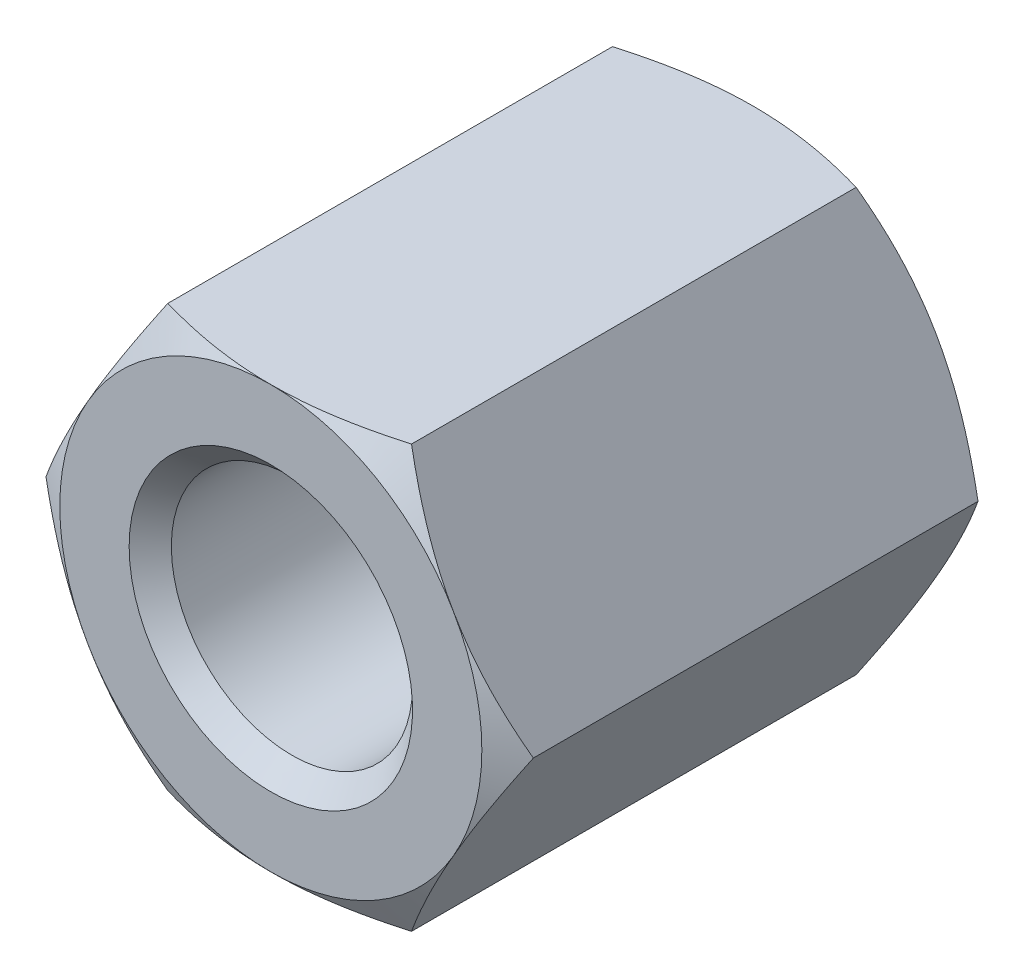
ISO-10303-21;
HEADER;
FILE_DESCRIPTION(('STEP AP214'),'2;1');
FILE_NAME('part.step','',(''),(''),'','','');
FILE_SCHEMA(('AUTOMOTIVE_DESIGN { 1 0 10303 214 1 1 1 1 }'));
ENDSEC;
DATA;
#1=APPLICATION_CONTEXT('core data for automotive mechanical design processes');
#2=APPLICATION_PROTOCOL_DEFINITION('international standard','automotive_design',2000,#1);
#3=PRODUCT_CONTEXT('',#1,'mechanical');
#4=PRODUCT('Part','Part','',(#3));
#5=PRODUCT_RELATED_PRODUCT_CATEGORY('part','',(#4));
#6=PRODUCT_DEFINITION_FORMATION('','',#4);
#7=PRODUCT_DEFINITION_CONTEXT('part definition',#1,'design');
#8=PRODUCT_DEFINITION('design','',#6,#7);
#9=PRODUCT_DEFINITION_SHAPE('','',#8);
#10=(LENGTH_UNIT() NAMED_UNIT(*) SI_UNIT(.MILLI.,.METRE.));
#11=(NAMED_UNIT(*) PLANE_ANGLE_UNIT() SI_UNIT($,.RADIAN.));
#12=(NAMED_UNIT(*) SI_UNIT($,.STERADIAN.) SOLID_ANGLE_UNIT());
#13=UNCERTAINTY_MEASURE_WITH_UNIT(LENGTH_MEASURE(1.E-05),#10,'distance_accuracy_value','');
#14=(GEOMETRIC_REPRESENTATION_CONTEXT(3) GLOBAL_UNCERTAINTY_ASSIGNED_CONTEXT((#13)) GLOBAL_UNIT_ASSIGNED_CONTEXT((#10,
#11,#12)) REPRESENTATION_CONTEXT('',''));
#15=CARTESIAN_POINT('',(0.,0.,0.));
#16=DIRECTION('',(0.,0.,1.));
#17=DIRECTION('',(1.,0.,0.));
#18=AXIS2_PLACEMENT_3D('',#15,#16,#17);
#19=CARTESIAN_POINT('',(4.04145188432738,0.,-4.));
#20=DIRECTION('',(0.866025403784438,0.5,0.));
#21=DIRECTION('',(-0.5,0.866025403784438,0.));
#22=AXIS2_PLACEMENT_3D('',#19,#20,#21);
#23=PLANE('',#22);
#24=CARTESIAN_POINT('',(4.04156735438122,-0.00019999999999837,3.68732593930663));
#25=CARTESIAN_POINT('',(3.9527667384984,0.153607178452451,3.73861421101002));
#26=CARTESIAN_POINT('',(3.86319960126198,0.308742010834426,3.7852590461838));
#27=CARTESIAN_POINT('',(3.68251437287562,0.621698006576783,3.86667812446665));
#28=CARTESIAN_POINT('',(3.59139307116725,0.779524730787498,3.90142356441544));
#29=CARTESIAN_POINT('',(3.41027974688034,1.09322221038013,3.95550997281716));
#30=CARTESIAN_POINT('',(3.32031559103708,1.24904469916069,3.97521091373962));
#31=CARTESIAN_POINT('',(3.13996396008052,1.56142288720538,3.99872986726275));
#32=CARTESIAN_POINT('',(3.04957714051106,1.71797745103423,4.00256735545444));
#33=CARTESIAN_POINT('',(2.88068384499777,2.01050921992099,3.99458469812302));
#34=CARTESIAN_POINT('',(2.80215208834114,2.14653021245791,3.98472456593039));
#35=CARTESIAN_POINT('',(2.64560020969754,2.417686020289,3.9534735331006));
#36=CARTESIAN_POINT('',(2.5675806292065,2.55281989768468,3.9320719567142));
#37=CARTESIAN_POINT('',(2.41070596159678,2.82453479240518,3.87856959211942));
#38=CARTESIAN_POINT('',(2.33187072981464,2.96108141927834,3.84624200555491));
#39=CARTESIAN_POINT('',(2.17537608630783,3.2321380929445,3.77287106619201));
#40=CARTESIAN_POINT('',(2.09771466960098,3.36665161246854,3.73184495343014));
#41=CARTESIAN_POINT('',(2.02061047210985,3.5002,3.68732593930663));
#42=B_SPLINE_CURVE_WITH_KNOTS('',3,(#24,#25,#26,#27,#28,#29,#30,#31,#32,#33,#34,#35,#36,#37,#38,
#39,#40,#41),.UNSPECIFIED.,.F.,.F.,(4,2,2,2,2,2,2,2,4),(0.,0.554793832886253,1.11092123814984,
1.65328467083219,2.19498204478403,2.6666513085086,3.13875761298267,3.62133612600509,
4.10296698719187),.UNSPECIFIED.);
#43=CARTESIAN_POINT('',(4.04145188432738,0.,3.68739260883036));
#44=VERTEX_POINT('',#43);
#45=CARTESIAN_POINT('',(3.03108891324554,1.75,4.));
#46=VERTEX_POINT('',#45);
#47=EDGE_CURVE('E127',#44,#46,#42,.T.);
#48=ORIENTED_EDGE('',*,*,#47,.F.);
#49=DIRECTION('',(0.,0.,1.));
#50=VECTOR('',#49,1.);
#51=CARTESIAN_POINT('',(4.04145188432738,0.,-4.));
#52=LINE('',#51,#50);
#53=CARTESIAN_POINT('',(4.04145188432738,0.,-3.68739260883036));
#54=VERTEX_POINT('',#53);
#55=EDGE_CURVE('E564',#54,#44,#52,.T.);
#56=ORIENTED_EDGE('',*,*,#55,.F.);
#57=CARTESIAN_POINT('',(4.04156735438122,-0.00019999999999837,-3.68732593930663));
#58=CARTESIAN_POINT('',(3.9527667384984,0.153607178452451,-3.73861421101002));
#59=CARTESIAN_POINT('',(3.86319960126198,0.308742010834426,-3.7852590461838));
#60=CARTESIAN_POINT('',(3.68251437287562,0.621698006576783,-3.86667812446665));
#61=CARTESIAN_POINT('',(3.59139307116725,0.779524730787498,-3.90142356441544));
#62=CARTESIAN_POINT('',(3.41027974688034,1.09322221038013,-3.95550997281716));
#63=CARTESIAN_POINT('',(3.32031559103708,1.24904469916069,-3.97521091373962));
#64=CARTESIAN_POINT('',(3.13996396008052,1.56142288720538,-3.99872986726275));
#65=CARTESIAN_POINT('',(3.04957714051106,1.71797745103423,-4.00256735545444));
#66=CARTESIAN_POINT('',(2.88068384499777,2.01050921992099,-3.99458469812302));
#67=CARTESIAN_POINT('',(2.80215208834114,2.14653021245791,-3.98472456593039));
#68=CARTESIAN_POINT('',(2.64560020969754,2.417686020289,-3.9534735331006));
#69=CARTESIAN_POINT('',(2.5675806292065,2.55281989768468,-3.9320719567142));
#70=CARTESIAN_POINT('',(2.41070596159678,2.82453479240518,-3.87856959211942));
#71=CARTESIAN_POINT('',(2.33187072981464,2.96108141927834,-3.84624200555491));
#72=CARTESIAN_POINT('',(2.17537608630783,3.2321380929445,-3.77287106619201));
#73=CARTESIAN_POINT('',(2.09771466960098,3.36665161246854,-3.73184495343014));
#74=CARTESIAN_POINT('',(2.02061047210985,3.5002,-3.68732593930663));
#75=B_SPLINE_CURVE_WITH_KNOTS('',3,(#57,#58,#59,#60,#61,#62,#63,#64,#65,#66,#67,#68,#69,#70,#71,
#72,#73,#74),.UNSPECIFIED.,.F.,.F.,(4,2,2,2,2,2,2,2,4),(0.,0.554793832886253,1.11092123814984,
1.65328467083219,2.19498204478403,2.6666513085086,3.13875761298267,3.62133612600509,
4.10296698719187),.UNSPECIFIED.);
#76=CARTESIAN_POINT('',(3.03108891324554,1.75,-4.));
#77=VERTEX_POINT('',#76);
#78=EDGE_CURVE('E568',#54,#77,#75,.T.);
#79=ORIENTED_EDGE('',*,*,#78,.T.);
#80=CARTESIAN_POINT('',(2.02072594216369,3.5,-3.68739260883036));
#81=VERTEX_POINT('',#80);
#82=EDGE_CURVE('E268',#77,#81,#75,.T.);
#83=ORIENTED_EDGE('',*,*,#82,.T.);
#84=DIRECTION('',(0.,0.,1.));
#85=VECTOR('',#84,1.);
#86=CARTESIAN_POINT('',(2.02072594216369,3.5,-4.));
#87=LINE('',#86,#85);
#88=CARTESIAN_POINT('',(2.02072594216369,3.5,3.68739260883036));
#89=VERTEX_POINT('',#88);
#90=EDGE_CURVE('E159',#81,#89,#87,.T.);
#91=ORIENTED_EDGE('',*,*,#90,.T.);
#92=EDGE_CURVE('E140',#46,#89,#42,.T.);
#93=ORIENTED_EDGE('',*,*,#92,.F.);
#94=EDGE_LOOP('',(#48,#56,#79,#83,#91,#93));
#95=FACE_BOUND('',#94,.T.);
#96=ADVANCED_FACE('F41',(#95),#23,.T.);
#97=CARTESIAN_POINT('',(2.02072594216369,-3.5,-4.));
#98=DIRECTION('',(0.866025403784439,-0.5,0.));
#99=DIRECTION('',(0.5,0.866025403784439,0.));
#100=AXIS2_PLACEMENT_3D('',#97,#98,#99);
#101=PLANE('',#100);
#102=CARTESIAN_POINT('',(2.02061047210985,-3.5002,3.68732593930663));
#103=CARTESIAN_POINT('',(2.10941108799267,-3.34639282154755,3.73861421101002));
#104=CARTESIAN_POINT('',(2.19897822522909,-3.19125798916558,3.7852590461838));
#105=CARTESIAN_POINT('',(2.37966345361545,-2.87830199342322,3.86667812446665));
#106=CARTESIAN_POINT('',(2.47078475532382,-2.7204752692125,3.90142356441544));
#107=CARTESIAN_POINT('',(2.65189807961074,-2.40677778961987,3.95550997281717));
#108=CARTESIAN_POINT('',(2.74186223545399,-2.25095530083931,3.97521091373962));
#109=CARTESIAN_POINT('',(2.92221386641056,-1.93857711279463,3.99872986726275));
#110=CARTESIAN_POINT('',(3.01260068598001,-1.78202254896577,4.00256735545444));
#111=CARTESIAN_POINT('',(3.1814939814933,-1.48949078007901,3.99458469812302));
#112=CARTESIAN_POINT('',(3.26002573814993,-1.35346978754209,3.98472456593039));
#113=CARTESIAN_POINT('',(3.41657761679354,-1.082313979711,3.9534735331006));
#114=CARTESIAN_POINT('',(3.49459719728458,-0.947180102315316,3.9320719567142));
#115=CARTESIAN_POINT('',(3.65147186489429,-0.675465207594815,3.87856959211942));
#116=CARTESIAN_POINT('',(3.73030709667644,-0.538918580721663,3.84624200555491));
#117=CARTESIAN_POINT('',(3.88680174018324,-0.267861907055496,3.77287106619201));
#118=CARTESIAN_POINT('',(3.96446315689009,-0.133348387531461,3.73184495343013));
#119=CARTESIAN_POINT('',(4.04156735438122,0.000200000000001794,3.68732593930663));
#120=B_SPLINE_CURVE_WITH_KNOTS('',3,(#102,#103,#104,#105,#106,#107,#108,#109,#110,#111,#112,
#113,#114,#115,#116,#117,#118,#119),.UNSPECIFIED.,.F.,.F.,(4,2,2,2,2,2,2,2,4),(0.,
0.554793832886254,1.11092123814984,1.65328467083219,2.19498204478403,2.6666513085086,
3.13875761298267,3.6213361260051,4.10296698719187),.UNSPECIFIED.);
#121=CARTESIAN_POINT('',(2.02072594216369,-3.5,3.68739260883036));
#122=VERTEX_POINT('',#121);
#123=CARTESIAN_POINT('',(3.03108891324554,-1.75,4.));
#124=VERTEX_POINT('',#123);
#125=EDGE_CURVE('E553',#122,#124,#120,.T.);
#126=ORIENTED_EDGE('',*,*,#125,.F.);
#127=DIRECTION('',(0.,0.,1.));
#128=VECTOR('',#127,1.);
#129=CARTESIAN_POINT('',(2.02072594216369,-3.5,-4.));
#130=LINE('',#129,#128);
#131=CARTESIAN_POINT('',(2.02072594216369,-3.5,-3.68739260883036));
#132=VERTEX_POINT('',#131);
#133=EDGE_CURVE('E282',#132,#122,#130,.T.);
#134=ORIENTED_EDGE('',*,*,#133,.F.);
#135=CARTESIAN_POINT('',(2.02061047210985,-3.5002,-3.68732593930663));
#136=CARTESIAN_POINT('',(2.10941108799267,-3.34639282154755,-3.73861421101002));
#137=CARTESIAN_POINT('',(2.19897822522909,-3.19125798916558,-3.7852590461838));
#138=CARTESIAN_POINT('',(2.37966345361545,-2.87830199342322,-3.86667812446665));
#139=CARTESIAN_POINT('',(2.47078475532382,-2.7204752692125,-3.90142356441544));
#140=CARTESIAN_POINT('',(2.65189807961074,-2.40677778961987,-3.95550997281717));
#141=CARTESIAN_POINT('',(2.74186223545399,-2.25095530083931,-3.97521091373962));
#142=CARTESIAN_POINT('',(2.92221386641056,-1.93857711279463,-3.99872986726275));
#143=CARTESIAN_POINT('',(3.01260068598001,-1.78202254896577,-4.00256735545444));
#144=CARTESIAN_POINT('',(3.1814939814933,-1.48949078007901,-3.99458469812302));
#145=CARTESIAN_POINT('',(3.26002573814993,-1.35346978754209,-3.98472456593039));
#146=CARTESIAN_POINT('',(3.41657761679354,-1.082313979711,-3.9534735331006));
#147=CARTESIAN_POINT('',(3.49459719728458,-0.947180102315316,-3.9320719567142));
#148=CARTESIAN_POINT('',(3.65147186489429,-0.675465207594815,-3.87856959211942));
#149=CARTESIAN_POINT('',(3.73030709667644,-0.538918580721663,-3.84624200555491));
#150=CARTESIAN_POINT('',(3.88680174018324,-0.267861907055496,-3.77287106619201));
#151=CARTESIAN_POINT('',(3.96446315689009,-0.133348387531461,-3.73184495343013));
#152=CARTESIAN_POINT('',(4.04156735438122,0.000200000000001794,-3.68732593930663));
#153=B_SPLINE_CURVE_WITH_KNOTS('',3,(#135,#136,#137,#138,#139,#140,#141,#142,#143,#144,#145,
#146,#147,#148,#149,#150,#151,#152),.UNSPECIFIED.,.F.,.F.,(4,2,2,2,2,2,2,2,4),(0.,
0.554793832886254,1.11092123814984,1.65328467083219,2.19498204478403,2.6666513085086,
3.13875761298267,3.6213361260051,4.10296698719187),.UNSPECIFIED.);
#154=CARTESIAN_POINT('',(3.03108891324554,-1.75,-4.));
#155=VERTEX_POINT('',#154);
#156=EDGE_CURVE('E554',#132,#155,#153,.T.);
#157=ORIENTED_EDGE('',*,*,#156,.T.);
#158=EDGE_CURVE('E283',#155,#54,#153,.T.);
#159=ORIENTED_EDGE('',*,*,#158,.T.);
#160=ORIENTED_EDGE('',*,*,#55,.T.);
#161=EDGE_CURVE('E132',#124,#44,#120,.T.);
#162=ORIENTED_EDGE('',*,*,#161,.F.);
#163=EDGE_LOOP('',(#126,#134,#157,#159,#160,#162));
#164=FACE_BOUND('',#163,.T.);
#165=ADVANCED_FACE('F253',(#164),#101,.T.);
#166=CARTESIAN_POINT('',(-2.02072594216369,-3.5,-4.));
#167=DIRECTION('',(0.,-1.,0.));
#168=DIRECTION('',(1.,0.,0.));
#169=AXIS2_PLACEMENT_3D('',#166,#167,#168);
#170=PLANE('',#169);
#171=CARTESIAN_POINT('',(-9.62975784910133,-3.5,0.105146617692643));
#172=CARTESIAN_POINT('',(-9.41477605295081,-3.5,0.221790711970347));
#173=CARTESIAN_POINT('',(-9.19961018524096,-3.5,0.338097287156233));
#174=CARTESIAN_POINT('',(-8.76881431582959,-3.5,0.569857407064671));
#175=CARTESIAN_POINT('',(-8.55318430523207,-3.5,0.685310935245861));
#176=CARTESIAN_POINT('',(-8.12120692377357,-3.5,0.915270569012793));
#177=CARTESIAN_POINT('',(-7.90485912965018,-3.5,1.02977588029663));
#178=CARTESIAN_POINT('',(-7.47148736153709,-3.5,1.25749687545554));
#179=CARTESIAN_POINT('',(-7.2544633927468,-3.5,1.37071256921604));
#180=CARTESIAN_POINT('',(-6.81218472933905,-3.5,1.59934512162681));
#181=CARTESIAN_POINT('',(-6.5869010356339,-3.5,1.71470597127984));
#182=CARTESIAN_POINT('',(-6.13520328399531,-3.5,1.94319180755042));
#183=CARTESIAN_POINT('',(-5.90878923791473,-3.5,2.05631681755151));
#184=CARTESIAN_POINT('',(-5.45458188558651,-3.5,2.27959153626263));
#185=CARTESIAN_POINT('',(-5.22678903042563,-3.5,2.38974215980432));
#186=CARTESIAN_POINT('',(-4.76933629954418,-3.5,2.60608409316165));
#187=CARTESIAN_POINT('',(-4.53967651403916,-3.5,2.71227559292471));
#188=CARTESIAN_POINT('',(-4.06781300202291,-3.5,2.9237403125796));
#189=CARTESIAN_POINT('',(-3.82549965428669,-3.5,3.0287706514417));
#190=CARTESIAN_POINT('',(-3.33725610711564,-3.5,3.23037863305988));
#191=CARTESIAN_POINT('',(-3.09132488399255,-3.5,3.32695382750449));
#192=CARTESIAN_POINT('',(-2.59717523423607,-3.5,3.50684242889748));
#193=CARTESIAN_POINT('',(-2.34899933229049,-3.5,3.59027078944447));
#194=CARTESIAN_POINT('',(-1.84726249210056,-3.5,3.73918883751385));
#195=CARTESIAN_POINT('',(-1.59370448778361,-3.5,3.80468804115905));
#196=CARTESIAN_POINT('',(-1.14666892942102,-3.5,3.8968005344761));
#197=CARTESIAN_POINT('',(-0.954380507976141,-3.5,3.92907238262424));
#198=CARTESIAN_POINT('',(-0.567708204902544,-3.5,3.97648967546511));
#199=CARTESIAN_POINT('',(-0.373325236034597,-3.5,3.99164229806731));
#200=CARTESIAN_POINT('',(0.0157722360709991,-3.5,4.00308893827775));
#201=CARTESIAN_POINT('',(0.210486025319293,-3.5,3.99940640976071));
#202=CARTESIAN_POINT('',(0.598684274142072,-3.5,3.97368148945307));
#203=CARTESIAN_POINT('',(0.792168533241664,-3.5,3.95163617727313));
#204=CARTESIAN_POINT('',(1.1674575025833,-3.5,3.89298885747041));
#205=CARTESIAN_POINT('',(1.34938151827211,-3.5,3.85712534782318));
#206=CARTESIAN_POINT('',(1.71054453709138,-3.5,3.77361429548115));
#207=CARTESIAN_POINT('',(1.88978213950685,-3.5,3.72596081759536));
#208=CARTESIAN_POINT('',(2.24591982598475,-3.5,3.62138019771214));
#209=CARTESIAN_POINT('',(2.42281383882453,-3.5,3.56443270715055));
#210=CARTESIAN_POINT('',(2.77413205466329,-3.5,3.44352315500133));
#211=CARTESIAN_POINT('',(2.94855661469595,-3.5,3.37956211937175));
#212=CARTESIAN_POINT('',(3.29855724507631,-3.5,3.24505102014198));
#213=CARTESIAN_POINT('',(3.47409443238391,-3.5,3.17440056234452));
#214=CARTESIAN_POINT('',(3.82339657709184,-3.5,3.02886167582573));
#215=CARTESIAN_POINT('',(3.99716149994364,-3.5,2.95397316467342));
#216=CARTESIAN_POINT('',(4.34301403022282,-3.5,2.80102429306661));
#217=CARTESIAN_POINT('',(4.51510352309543,-3.5,2.72296817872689));
#218=CARTESIAN_POINT('',(4.85810152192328,-3.5,2.56430048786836));
#219=CARTESIAN_POINT('',(5.02901000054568,-3.5,2.48368885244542));
#220=CARTESIAN_POINT('',(5.39051152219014,-3.5,2.31054992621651));
#221=CARTESIAN_POINT('',(5.5809797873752,-3.5,2.21776259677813));
#222=CARTESIAN_POINT('',(5.96093074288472,-3.5,2.03019416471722));
#223=CARTESIAN_POINT('',(6.1504134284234,-3.5,1.93541305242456));
#224=CARTESIAN_POINT('',(6.71780908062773,-3.5,1.64864451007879));
#225=CARTESIAN_POINT('',(7.0945297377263,-3.5,1.45429969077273));
#226=CARTESIAN_POINT('',(7.83183263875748,-3.5,1.06881475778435));
#227=CARTESIAN_POINT('',(8.19249369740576,-3.5,0.877824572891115));
#228=CARTESIAN_POINT('',(8.73231659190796,-3.5,0.589374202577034));
#229=CARTESIAN_POINT('',(8.91201751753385,-3.5,0.492921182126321));
#230=CARTESIAN_POINT('',(9.27110833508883,-3.5,0.299440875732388));
#231=CARTESIAN_POINT('',(9.45049822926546,-3.5,0.202413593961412));
#232=CARTESIAN_POINT('',(9.62975784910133,-3.5,0.105146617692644));
#233=B_SPLINE_CURVE_WITH_KNOTS('',3,(#171,#172,#173,#174,#175,#176,#177,#178,#179,#180,#181,
#182,#183,#184,#185,#186,#187,#188,#189,#190,#191,#192,#193,#194,#195,#196,#197,#198,#199,#200,
#201,#202,#203,#204,#205,#206,#207,#208,#209,#210,#211,#212,#213,#214,#215,#216,#217,#218,#219,
#220,#221,#222,#223,#224,#225,#226,#227,#228,#229,#230,#231,#232),.UNSPECIFIED.,.F.,.F.,(4,2,2,
2,2,2,2,2,2,2,2,2,2,2,2,2,2,2,2,2,2,2,2,2,2,2,2,2,2,2,4),(0.,0.733763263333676,1.46754071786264,
2.20188078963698,2.93621522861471,3.69551319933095,4.45480322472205,5.21385699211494,
5.97287429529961,6.76505762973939,7.55746959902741,8.34251408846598,9.12714109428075,
9.71143874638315,10.2954913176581,10.8788167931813,11.4622350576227,12.0180350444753,
12.5741153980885,13.1314299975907,13.6886631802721,14.2562564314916,14.8238607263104,
15.3907277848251,15.9576079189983,16.5931938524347,17.2287828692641,18.5004272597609,
19.7247436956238,20.3365928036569,20.9484374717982),.UNSPECIFIED.);
#234=CARTESIAN_POINT('',(-2.02072594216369,-3.5,3.68739260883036));
#235=VERTEX_POINT('',#234);
#236=CARTESIAN_POINT('',(0.,-3.5,4.));
#237=VERTEX_POINT('',#236);
#238=EDGE_CURVE('E551',#235,#237,#233,.T.);
#239=ORIENTED_EDGE('',*,*,#238,.F.);
#240=DIRECTION('',(0.,0.,1.));
#241=VECTOR('',#240,1.);
#242=CARTESIAN_POINT('',(-2.02072594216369,-3.5,-4.));
#243=LINE('',#242,#241);
#244=CARTESIAN_POINT('',(-2.02072594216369,-3.5,-3.68739260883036));
#245=VERTEX_POINT('',#244);
#246=EDGE_CURVE('E525',#245,#235,#243,.T.);
#247=ORIENTED_EDGE('',*,*,#246,.F.);
#248=CARTESIAN_POINT('',(-7.42701323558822,-3.5,-1.28045430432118));
#249=CARTESIAN_POINT('',(-7.25533674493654,-3.5,-1.37010370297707));
#250=CARTESIAN_POINT('',(-7.08343573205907,-3.5,-1.45932651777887));
#251=CARTESIAN_POINT('',(-6.73907398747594,-3.5,-1.63670242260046));
#252=CARTESIAN_POINT('',(-6.56661323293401,-3.5,-1.72485546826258));
#253=CARTESIAN_POINT('',(-6.22078191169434,-3.5,-1.89999625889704));
#254=CARTESIAN_POINT('',(-6.04741038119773,-3.5,-1.98698210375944));
#255=CARTESIAN_POINT('',(-5.69987438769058,-3.5,-2.15935104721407));
#256=CARTESIAN_POINT('',(-5.52570993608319,-3.5,-2.24473416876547));
#257=CARTESIAN_POINT('',(-5.16654375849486,-3.5,-2.41827481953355));
#258=CARTESIAN_POINT('',(-4.98148586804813,-3.5,-2.50631641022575));
#259=CARTESIAN_POINT('',(-4.61003992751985,-3.5,-2.67954488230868));
#260=CARTESIAN_POINT('',(-4.42365190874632,-3.5,-2.76473183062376));
#261=CARTESIAN_POINT('',(-4.04930722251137,-3.5,-2.93135333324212));
#262=CARTESIAN_POINT('',(-3.86135136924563,-3.5,-3.01278970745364));
#263=CARTESIAN_POINT('',(-3.48339737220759,-3.5,-3.17075202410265));
#264=CARTESIAN_POINT('',(-3.29339942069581,-3.5,-3.24727842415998));
#265=CARTESIAN_POINT('',(-2.88879155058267,-3.5,-3.40222876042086));
#266=CARTESIAN_POINT('',(-2.67387112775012,-3.5,-3.47985298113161));
#267=CARTESIAN_POINT('',(-2.2401606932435,-3.5,-3.62372794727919));
#268=CARTESIAN_POINT('',(-2.02137007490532,-3.5,-3.68997689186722));
#269=CARTESIAN_POINT('',(-1.58402635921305,-3.5,-3.80545620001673));
#270=CARTESIAN_POINT('',(-1.36556203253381,-3.5,-3.85501036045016));
#271=CARTESIAN_POINT('',(-1.03521635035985,-3.5,-3.91433016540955));
#272=CARTESIAN_POINT('',(-0.924671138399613,-3.5,-3.9316005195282));
#273=CARTESIAN_POINT('',(-0.70286356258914,-3.5,-3.96059965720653));
#274=CARTESIAN_POINT('',(-0.591601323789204,-3.5,-3.97232938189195));
#275=CARTESIAN_POINT('',(-0.366597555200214,-3.5,-3.98998283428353));
#276=CARTESIAN_POINT('',(-0.252847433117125,-3.5,-3.99579831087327));
#277=CARTESIAN_POINT('',(-0.0251993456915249,-3.5,-4.00101473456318));
#278=CARTESIAN_POINT('',(0.088698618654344,-3.5,-4.00041572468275));
#279=CARTESIAN_POINT('',(0.316293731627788,-3.5,-3.9928259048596));
#280=CARTESIAN_POINT('',(0.429990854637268,-3.5,-3.98583433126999));
#281=CARTESIAN_POINT('',(0.656835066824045,-3.5,-3.96574426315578));
#282=CARTESIAN_POINT('',(0.76998214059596,-3.5,-3.95264559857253));
#283=CARTESIAN_POINT('',(1.11305824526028,-3.5,-3.90419352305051));
#284=CARTESIAN_POINT('',(1.34174334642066,-3.5,-3.85987610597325));
#285=CARTESIAN_POINT('',(1.79472852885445,-3.5,-3.75297722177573));
#286=CARTESIAN_POINT('',(2.01902618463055,-3.5,-3.69038594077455));
#287=CARTESIAN_POINT('',(2.47537394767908,-3.5,-3.54830524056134));
#288=CARTESIAN_POINT('',(2.7071936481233,-3.5,-3.46808894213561));
#289=CARTESIAN_POINT('',(3.1670629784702,-3.5,-3.29741465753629));
#290=CARTESIAN_POINT('',(3.39511116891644,-3.5,-3.20695285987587));
#291=CARTESIAN_POINT('',(3.84854070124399,-3.5,-3.01870178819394));
#292=CARTESIAN_POINT('',(4.07391747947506,-3.5,-2.92090162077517));
#293=CARTESIAN_POINT('',(4.52231035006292,-3.5,-2.72015619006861));
#294=CARTESIAN_POINT('',(4.74532680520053,-3.5,-2.61721173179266));
#295=CARTESIAN_POINT('',(5.17521367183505,-3.5,-2.4143174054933));
#296=CARTESIAN_POINT('',(5.38219614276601,-3.5,-2.31460392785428));
#297=CARTESIAN_POINT('',(5.79493193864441,-3.5,-2.11264648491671));
#298=CARTESIAN_POINT('',(6.00068520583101,-3.5,-2.01040240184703));
#299=CARTESIAN_POINT('',(6.41032438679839,-3.5,-1.80440255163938));
#300=CARTESIAN_POINT('',(6.61421452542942,-3.5,-1.70065516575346));
#301=CARTESIAN_POINT('',(7.02117699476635,-3.5,-1.49161781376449));
#302=CARTESIAN_POINT('',(7.22424940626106,-3.5,-1.38632800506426));
#303=CARTESIAN_POINT('',(7.42701323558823,-3.5,-1.28045430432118));
#304=B_SPLINE_CURVE_WITH_KNOTS('',3,(#248,#249,#250,#251,#252,#253,#254,#255,#256,#257,#258,
#259,#260,#261,#262,#263,#264,#265,#266,#267,#268,#269,#270,#271,#272,#273,#274,#275,#276,#277,
#278,#279,#280,#281,#282,#283,#284,#285,#286,#287,#288,#289,#290,#291,#292,#293,#294,#295,#296,
#297,#298,#299,#300,#301,#302,#303),.UNSPECIFIED.,.F.,.F.,(4,2,2,2,2,2,2,2,2,2,2,2,2,2,2,2,2,2,
2,2,2,2,2,2,2,2,2,4),(0.,0.581025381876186,1.1620747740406,1.74397693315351,2.3258707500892,
2.94065242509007,3.55541967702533,4.16988541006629,4.78429379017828,5.46958840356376,
6.15499140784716,6.82621140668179,7.16175214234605,7.49723586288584,7.83875520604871,
8.18027225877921,8.52183011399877,8.86339748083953,9.56110665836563,10.2591912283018,
10.9947590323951,11.7306013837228,12.467558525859,13.2044007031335,13.8936259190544,
14.5828832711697,15.2691795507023,15.9554062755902),.UNSPECIFIED.);
#305=CARTESIAN_POINT('',(0.,-3.5,-4.));
#306=VERTEX_POINT('',#305);
#307=EDGE_CURVE('E535',#245,#306,#304,.T.);
#308=ORIENTED_EDGE('',*,*,#307,.T.);
#309=EDGE_CURVE('E258',#306,#132,#304,.T.);
#310=ORIENTED_EDGE('',*,*,#309,.T.);
#311=ORIENTED_EDGE('',*,*,#133,.T.);
#312=EDGE_CURVE('E138',#237,#122,#233,.T.);
#313=ORIENTED_EDGE('',*,*,#312,.F.);
#314=EDGE_LOOP('',(#239,#247,#308,#310,#311,#313));
#315=FACE_BOUND('',#314,.T.);
#316=ADVANCED_FACE('F291',(#315),#170,.T.);
#317=CARTESIAN_POINT('',(-4.04145188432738,0.,-4.));
#318=DIRECTION('',(-0.866025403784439,-0.5,0.));
#319=DIRECTION('',(0.5,-0.866025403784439,0.));
#320=AXIS2_PLACEMENT_3D('',#317,#318,#319);
#321=PLANE('',#320);
#322=CARTESIAN_POINT('',(-4.04156735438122,0.000199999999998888,3.68732593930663));
#323=CARTESIAN_POINT('',(-3.9527667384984,-0.153607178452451,3.73861421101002));
#324=CARTESIAN_POINT('',(-3.86319960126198,-0.308742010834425,3.78525904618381));
#325=CARTESIAN_POINT('',(-3.68251437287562,-0.621698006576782,3.86667812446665));
#326=CARTESIAN_POINT('',(-3.59139307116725,-0.779524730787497,3.90142356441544));
#327=CARTESIAN_POINT('',(-3.41027974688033,-1.09322221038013,3.95550997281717));
#328=CARTESIAN_POINT('',(-3.32031559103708,-1.24904469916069,3.97521091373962));
#329=CARTESIAN_POINT('',(-3.13996396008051,-1.56142288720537,3.99872986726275));
#330=CARTESIAN_POINT('',(-3.04957714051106,-1.71797745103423,4.00256735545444));
#331=CARTESIAN_POINT('',(-2.88068384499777,-2.01050921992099,3.99458469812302));
#332=CARTESIAN_POINT('',(-2.80215208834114,-2.14653021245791,3.98472456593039));
#333=CARTESIAN_POINT('',(-2.64560020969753,-2.417686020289,3.9534735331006));
#334=CARTESIAN_POINT('',(-2.56758062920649,-2.55281989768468,3.9320719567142));
#335=CARTESIAN_POINT('',(-2.41070596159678,-2.82453479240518,3.87856959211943));
#336=CARTESIAN_POINT('',(-2.33187072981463,-2.96108141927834,3.84624200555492));
#337=CARTESIAN_POINT('',(-2.17537608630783,-3.2321380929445,3.77287106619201));
#338=CARTESIAN_POINT('',(-2.09771466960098,-3.36665161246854,3.73184495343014));
#339=CARTESIAN_POINT('',(-2.02061047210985,-3.5002,3.68732593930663));
#340=B_SPLINE_CURVE_WITH_KNOTS('',3,(#322,#323,#324,#325,#326,#327,#328,#329,#330,#331,#332,
#333,#334,#335,#336,#337,#338,#339),.UNSPECIFIED.,.F.,.F.,(4,2,2,2,2,2,2,2,4),(0.,
0.554793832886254,1.11092123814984,1.65328467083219,2.19498204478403,2.6666513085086,
3.13875761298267,3.6213361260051,4.10296698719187),.UNSPECIFIED.);
#341=CARTESIAN_POINT('',(-4.04145188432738,0.,3.68739260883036));
#342=VERTEX_POINT('',#341);
#343=CARTESIAN_POINT('',(-3.03108891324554,-1.75,4.));
#344=VERTEX_POINT('',#343);
#345=EDGE_CURVE('E175',#342,#344,#340,.T.);
#346=ORIENTED_EDGE('',*,*,#345,.F.);
#347=DIRECTION('',(0.,0.,1.));
#348=VECTOR('',#347,1.);
#349=CARTESIAN_POINT('',(-4.04145188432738,0.,-4.));
#350=LINE('',#349,#348);
#351=CARTESIAN_POINT('',(-4.04145188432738,0.,-3.68739260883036));
#352=VERTEX_POINT('',#351);
#353=EDGE_CURVE('E578',#352,#342,#350,.T.);
#354=ORIENTED_EDGE('',*,*,#353,.F.);
#355=CARTESIAN_POINT('',(-4.04156735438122,0.000199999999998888,-3.68732593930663));
#356=CARTESIAN_POINT('',(-3.9527667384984,-0.153607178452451,-3.73861421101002));
#357=CARTESIAN_POINT('',(-3.86319960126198,-0.308742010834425,-3.78525904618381));
#358=CARTESIAN_POINT('',(-3.68251437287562,-0.621698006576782,-3.86667812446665));
#359=CARTESIAN_POINT('',(-3.59139307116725,-0.779524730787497,-3.90142356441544));
#360=CARTESIAN_POINT('',(-3.41027974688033,-1.09322221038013,-3.95550997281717));
#361=CARTESIAN_POINT('',(-3.32031559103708,-1.24904469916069,-3.97521091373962));
#362=CARTESIAN_POINT('',(-3.13996396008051,-1.56142288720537,-3.99872986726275));
#363=CARTESIAN_POINT('',(-3.04957714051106,-1.71797745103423,-4.00256735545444));
#364=CARTESIAN_POINT('',(-2.88068384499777,-2.01050921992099,-3.99458469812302));
#365=CARTESIAN_POINT('',(-2.80215208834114,-2.14653021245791,-3.98472456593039));
#366=CARTESIAN_POINT('',(-2.64560020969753,-2.417686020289,-3.9534735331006));
#367=CARTESIAN_POINT('',(-2.56758062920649,-2.55281989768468,-3.9320719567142));
#368=CARTESIAN_POINT('',(-2.41070596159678,-2.82453479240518,-3.87856959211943));
#369=CARTESIAN_POINT('',(-2.33187072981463,-2.96108141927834,-3.84624200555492));
#370=CARTESIAN_POINT('',(-2.17537608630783,-3.2321380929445,-3.77287106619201));
#371=CARTESIAN_POINT('',(-2.09771466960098,-3.36665161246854,-3.73184495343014));
#372=CARTESIAN_POINT('',(-2.02061047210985,-3.5002,-3.68732593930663));
#373=B_SPLINE_CURVE_WITH_KNOTS('',3,(#355,#356,#357,#358,#359,#360,#361,#362,#363,#364,#365,
#366,#367,#368,#369,#370,#371,#372),.UNSPECIFIED.,.F.,.F.,(4,2,2,2,2,2,2,2,4),(0.,
0.554793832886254,1.11092123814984,1.65328467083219,2.19498204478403,2.6666513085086,
3.13875761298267,3.6213361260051,4.10296698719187),.UNSPECIFIED.);
#374=CARTESIAN_POINT('',(-3.03108891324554,-1.75,-4.));
#375=VERTEX_POINT('',#374);
#376=EDGE_CURVE('E274',#352,#375,#373,.T.);
#377=ORIENTED_EDGE('',*,*,#376,.T.);
#378=EDGE_CURVE('E281',#375,#245,#373,.T.);
#379=ORIENTED_EDGE('',*,*,#378,.T.);
#380=ORIENTED_EDGE('',*,*,#246,.T.);
#381=EDGE_CURVE('E543',#344,#235,#340,.T.);
#382=ORIENTED_EDGE('',*,*,#381,.F.);
#383=EDGE_LOOP('',(#346,#354,#377,#379,#380,#382));
#384=FACE_BOUND('',#383,.T.);
#385=ADVANCED_FACE('F288',(#384),#321,.T.);
#386=CARTESIAN_POINT('',(-2.02072594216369,3.5,-4.));
#387=DIRECTION('',(-0.866025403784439,0.499999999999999,0.));
#388=DIRECTION('',(-0.5,-0.866025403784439,0.));
#389=AXIS2_PLACEMENT_3D('',#386,#387,#388);
#390=PLANE('',#389);
#391=CARTESIAN_POINT('',(-2.02061047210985,3.5002,3.68732593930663));
#392=CARTESIAN_POINT('',(-2.10941108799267,3.34639282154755,3.73861421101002));
#393=CARTESIAN_POINT('',(-2.19897822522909,3.19125798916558,3.78525904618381));
#394=CARTESIAN_POINT('',(-2.37966345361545,2.87830199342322,3.86667812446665));
#395=CARTESIAN_POINT('',(-2.47078475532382,2.7204752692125,3.90142356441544));
#396=CARTESIAN_POINT('',(-2.65189807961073,2.40677778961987,3.95550997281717));
#397=CARTESIAN_POINT('',(-2.74186223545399,2.25095530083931,3.97521091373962));
#398=CARTESIAN_POINT('',(-2.92221386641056,1.93857711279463,3.99872986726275));
#399=CARTESIAN_POINT('',(-3.01260068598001,1.78202254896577,4.00256735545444));
#400=CARTESIAN_POINT('',(-3.1814939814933,1.48949078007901,3.99458469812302));
#401=CARTESIAN_POINT('',(-3.26002573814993,1.35346978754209,3.98472456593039));
#402=CARTESIAN_POINT('',(-3.41657761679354,1.082313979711,3.9534735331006));
#403=CARTESIAN_POINT('',(-3.49459719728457,0.947180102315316,3.9320719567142));
#404=CARTESIAN_POINT('',(-3.65147186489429,0.675465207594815,3.87856959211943));
#405=CARTESIAN_POINT('',(-3.73030709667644,0.538918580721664,3.84624200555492));
#406=CARTESIAN_POINT('',(-3.88680174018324,0.267861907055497,3.77287106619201));
#407=CARTESIAN_POINT('',(-3.96446315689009,0.133348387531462,3.73184495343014));
#408=CARTESIAN_POINT('',(-4.04156735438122,-0.000200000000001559,3.68732593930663));
#409=B_SPLINE_CURVE_WITH_KNOTS('',3,(#391,#392,#393,#394,#395,#396,#397,#398,#399,#400,#401,
#402,#403,#404,#405,#406,#407,#408),.UNSPECIFIED.,.F.,.F.,(4,2,2,2,2,2,2,2,4),(0.,
0.554793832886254,1.11092123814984,1.65328467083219,2.19498204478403,2.6666513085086,
3.13875761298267,3.6213361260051,4.10296698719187),.UNSPECIFIED.);
#410=CARTESIAN_POINT('',(-2.02072594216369,3.5,3.68739260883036));
#411=VERTEX_POINT('',#410);
#412=CARTESIAN_POINT('',(-3.03108891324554,1.75,4.));
#413=VERTEX_POINT('',#412);
#414=EDGE_CURVE('E182',#411,#413,#409,.T.);
#415=ORIENTED_EDGE('',*,*,#414,.F.);
#416=DIRECTION('',(0.,0.,1.));
#417=VECTOR('',#416,1.);
#418=CARTESIAN_POINT('',(-2.02072594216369,3.5,-4.));
#419=LINE('',#418,#417);
#420=CARTESIAN_POINT('',(-2.02072594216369,3.5,-3.68739260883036));
#421=VERTEX_POINT('',#420);
#422=EDGE_CURVE('E232',#421,#411,#419,.T.);
#423=ORIENTED_EDGE('',*,*,#422,.F.);
#424=CARTESIAN_POINT('',(-2.02061047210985,3.5002,-3.68732593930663));
#425=CARTESIAN_POINT('',(-2.10941108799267,3.34639282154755,-3.73861421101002));
#426=CARTESIAN_POINT('',(-2.19897822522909,3.19125798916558,-3.78525904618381));
#427=CARTESIAN_POINT('',(-2.37966345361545,2.87830199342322,-3.86667812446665));
#428=CARTESIAN_POINT('',(-2.47078475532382,2.7204752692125,-3.90142356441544));
#429=CARTESIAN_POINT('',(-2.65189807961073,2.40677778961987,-3.95550997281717));
#430=CARTESIAN_POINT('',(-2.74186223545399,2.25095530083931,-3.97521091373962));
#431=CARTESIAN_POINT('',(-2.92221386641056,1.93857711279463,-3.99872986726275));
#432=CARTESIAN_POINT('',(-3.01260068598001,1.78202254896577,-4.00256735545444));
#433=CARTESIAN_POINT('',(-3.1814939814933,1.48949078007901,-3.99458469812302));
#434=CARTESIAN_POINT('',(-3.26002573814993,1.35346978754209,-3.98472456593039));
#435=CARTESIAN_POINT('',(-3.41657761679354,1.082313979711,-3.9534735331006));
#436=CARTESIAN_POINT('',(-3.49459719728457,0.947180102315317,-3.9320719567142));
#437=CARTESIAN_POINT('',(-3.65147186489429,0.675465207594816,-3.87856959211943));
#438=CARTESIAN_POINT('',(-3.73030709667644,0.538918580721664,-3.84624200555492));
#439=CARTESIAN_POINT('',(-3.88680174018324,0.267861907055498,-3.77287106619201));
#440=CARTESIAN_POINT('',(-3.96446315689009,0.133348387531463,-3.73184495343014));
#441=CARTESIAN_POINT('',(-4.04156735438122,-0.000200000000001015,-3.68732593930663));
#442=B_SPLINE_CURVE_WITH_KNOTS('',3,(#424,#425,#426,#427,#428,#429,#430,#431,#432,#433,#434,
#435,#436,#437,#438,#439,#440,#441),.UNSPECIFIED.,.F.,.F.,(4,2,2,2,2,2,2,2,4),(0.,
0.554793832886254,1.11092123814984,1.65328467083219,2.19498204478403,2.6666513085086,
3.13875761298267,3.62133612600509,4.10296698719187),.UNSPECIFIED.);
#443=CARTESIAN_POINT('',(-3.03108891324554,1.75,-4.));
#444=VERTEX_POINT('',#443);
#445=EDGE_CURVE('E236',#421,#444,#442,.T.);
#446=ORIENTED_EDGE('',*,*,#445,.T.);
#447=EDGE_CURVE('E532',#444,#352,#442,.T.);
#448=ORIENTED_EDGE('',*,*,#447,.T.);
#449=ORIENTED_EDGE('',*,*,#353,.T.);
#450=EDGE_CURVE('E541',#413,#342,#409,.T.);
#451=ORIENTED_EDGE('',*,*,#450,.F.);
#452=EDGE_LOOP('',(#415,#423,#446,#448,#449,#451));
#453=FACE_BOUND('',#452,.T.);
#454=ADVANCED_FACE('F217',(#453),#390,.T.);
#455=CARTESIAN_POINT('',(2.02072594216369,3.5,-4.));
#456=DIRECTION('',(0.,1.,0.));
#457=DIRECTION('',(0.,0.,1.));
#458=AXIS2_PLACEMENT_3D('',#455,#456,#457);
#459=PLANE('',#458);
#460=CARTESIAN_POINT('',(9.62975784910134,3.5,0.105146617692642));
#461=CARTESIAN_POINT('',(9.41477605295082,3.5,0.221790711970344));
#462=CARTESIAN_POINT('',(9.19961018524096,3.5,0.338097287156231));
#463=CARTESIAN_POINT('',(8.76881431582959,3.5,0.56985740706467));
#464=CARTESIAN_POINT('',(8.55318430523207,3.5,0.68531093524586));
#465=CARTESIAN_POINT('',(8.12120692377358,3.5,0.915270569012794));
#466=CARTESIAN_POINT('',(7.90485912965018,3.5,1.02977588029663));
#467=CARTESIAN_POINT('',(7.4714873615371,3.5,1.25749687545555));
#468=CARTESIAN_POINT('',(7.25446339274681,3.5,1.37071256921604));
#469=CARTESIAN_POINT('',(6.81218472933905,3.5,1.59934512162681));
#470=CARTESIAN_POINT('',(6.5869010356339,3.5,1.71470597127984));
#471=CARTESIAN_POINT('',(6.13520328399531,3.5,1.94319180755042));
#472=CARTESIAN_POINT('',(5.90878923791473,3.5,2.05631681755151));
#473=CARTESIAN_POINT('',(5.45458188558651,3.5,2.27959153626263));
#474=CARTESIAN_POINT('',(5.22678903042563,3.5,2.38974215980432));
#475=CARTESIAN_POINT('',(4.76933629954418,3.5,2.60608409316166));
#476=CARTESIAN_POINT('',(4.53967651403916,3.5,2.71227559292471));
#477=CARTESIAN_POINT('',(4.06781300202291,3.5,2.9237403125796));
#478=CARTESIAN_POINT('',(3.82549965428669,3.5,3.02877065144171));
#479=CARTESIAN_POINT('',(3.33725610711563,3.5,3.23037863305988));
#480=CARTESIAN_POINT('',(3.09132488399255,3.5,3.32695382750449));
#481=CARTESIAN_POINT('',(2.59717523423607,3.5,3.50684242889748));
#482=CARTESIAN_POINT('',(2.34899933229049,3.5,3.59027078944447));
#483=CARTESIAN_POINT('',(1.84726249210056,3.5,3.73918883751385));
#484=CARTESIAN_POINT('',(1.59370448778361,3.5,3.80468804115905));
#485=CARTESIAN_POINT('',(1.14666892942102,3.5,3.8968005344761));
#486=CARTESIAN_POINT('',(0.954380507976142,3.5,3.92907238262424));
#487=CARTESIAN_POINT('',(0.567708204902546,3.5,3.97648967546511));
#488=CARTESIAN_POINT('',(0.373325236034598,3.5,3.99164229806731));
#489=CARTESIAN_POINT('',(-0.0157722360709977,3.5,4.00308893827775));
#490=CARTESIAN_POINT('',(-0.210486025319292,3.5,3.99940640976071));
#491=CARTESIAN_POINT('',(-0.598684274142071,3.5,3.97368148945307));
#492=CARTESIAN_POINT('',(-0.792168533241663,3.5,3.95163617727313));
#493=CARTESIAN_POINT('',(-1.1674575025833,3.5,3.89298885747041));
#494=CARTESIAN_POINT('',(-1.34938151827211,3.5,3.85712534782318));
#495=CARTESIAN_POINT('',(-1.71054453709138,3.5,3.77361429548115));
#496=CARTESIAN_POINT('',(-1.88978213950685,3.5,3.72596081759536));
#497=CARTESIAN_POINT('',(-2.24591982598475,3.5,3.62138019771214));
#498=CARTESIAN_POINT('',(-2.42281383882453,3.5,3.56443270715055));
#499=CARTESIAN_POINT('',(-2.77413205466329,3.5,3.44352315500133));
#500=CARTESIAN_POINT('',(-2.94855661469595,3.5,3.37956211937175));
#501=CARTESIAN_POINT('',(-3.29855724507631,3.5,3.24505102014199));
#502=CARTESIAN_POINT('',(-3.47409443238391,3.5,3.17440056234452));
#503=CARTESIAN_POINT('',(-3.82339657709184,3.5,3.02886167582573));
#504=CARTESIAN_POINT('',(-3.99716149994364,3.5,2.95397316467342));
#505=CARTESIAN_POINT('',(-4.34301403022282,3.5,2.80102429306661));
#506=CARTESIAN_POINT('',(-4.51510352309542,3.5,2.72296817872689));
#507=CARTESIAN_POINT('',(-4.85810152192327,3.5,2.56430048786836));
#508=CARTESIAN_POINT('',(-5.02901000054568,3.5,2.48368885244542));
#509=CARTESIAN_POINT('',(-5.39051152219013,3.5,2.31054992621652));
#510=CARTESIAN_POINT('',(-5.5809797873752,3.5,2.21776259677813));
#511=CARTESIAN_POINT('',(-5.96093074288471,3.5,2.03019416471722));
#512=CARTESIAN_POINT('',(-6.1504134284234,3.5,1.93541305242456));
#513=CARTESIAN_POINT('',(-6.71780908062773,3.5,1.64864451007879));
#514=CARTESIAN_POINT('',(-7.0945297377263,3.5,1.45429969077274));
#515=CARTESIAN_POINT('',(-7.83183263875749,3.5,1.06881475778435));
#516=CARTESIAN_POINT('',(-8.19249369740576,3.5,0.877824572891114));
#517=CARTESIAN_POINT('',(-8.73231659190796,3.5,0.589374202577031));
#518=CARTESIAN_POINT('',(-8.91201751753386,3.5,0.492921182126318));
#519=CARTESIAN_POINT('',(-9.27110833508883,3.5,0.299440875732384));
#520=CARTESIAN_POINT('',(-9.45049822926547,3.5,0.202413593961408));
#521=CARTESIAN_POINT('',(-9.62975784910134,3.5,0.105146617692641));
#522=B_SPLINE_CURVE_WITH_KNOTS('',3,(#460,#461,#462,#463,#464,#465,#466,#467,#468,#469,#470,
#471,#472,#473,#474,#475,#476,#477,#478,#479,#480,#481,#482,#483,#484,#485,#486,#487,#488,#489,
#490,#491,#492,#493,#494,#495,#496,#497,#498,#499,#500,#501,#502,#503,#504,#505,#506,#507,#508,
#509,#510,#511,#512,#513,#514,#515,#516,#517,#518,#519,#520,#521),.UNSPECIFIED.,.F.,.F.,(4,2,2,
2,2,2,2,2,2,2,2,2,2,2,2,2,2,2,2,2,2,2,2,2,2,2,2,2,2,2,4),(0.,0.733763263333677,1.46754071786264,
2.20188078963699,2.93621522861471,3.69551319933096,4.45480322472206,5.21385699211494,
5.97287429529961,6.7650576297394,7.55746959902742,8.34251408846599,9.12714109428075,
9.71143874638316,10.2954913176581,10.8788167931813,11.4622350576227,12.0180350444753,
12.5741153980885,13.1314299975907,13.6886631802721,14.2562564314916,14.8238607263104,
15.3907277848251,15.9576079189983,16.5931938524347,17.2287828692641,18.5004272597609,
19.7247436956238,20.3365928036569,20.9484374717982),.UNSPECIFIED.);
#523=CARTESIAN_POINT('',(0.,3.5,4.));
#524=VERTEX_POINT('',#523);
#525=EDGE_CURVE('E145',#89,#524,#522,.T.);
#526=ORIENTED_EDGE('',*,*,#525,.F.);
#527=ORIENTED_EDGE('',*,*,#90,.F.);
#528=CARTESIAN_POINT('',(7.42701323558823,3.5,-1.28045430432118));
#529=CARTESIAN_POINT('',(7.25533674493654,3.5,-1.37010370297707));
#530=CARTESIAN_POINT('',(7.08343573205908,3.5,-1.45932651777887));
#531=CARTESIAN_POINT('',(6.73907398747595,3.5,-1.63670242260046));
#532=CARTESIAN_POINT('',(6.56661323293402,3.5,-1.72485546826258));
#533=CARTESIAN_POINT('',(6.22078191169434,3.5,-1.89999625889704));
#534=CARTESIAN_POINT('',(6.04741038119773,3.5,-1.98698210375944));
#535=CARTESIAN_POINT('',(5.69987438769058,3.5,-2.15935104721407));
#536=CARTESIAN_POINT('',(5.52570993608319,3.5,-2.24473416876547));
#537=CARTESIAN_POINT('',(5.16654375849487,3.5,-2.41827481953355));
#538=CARTESIAN_POINT('',(4.98148586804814,3.5,-2.50631641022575));
#539=CARTESIAN_POINT('',(4.61003992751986,3.5,-2.67954488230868));
#540=CARTESIAN_POINT('',(4.42365190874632,3.5,-2.76473183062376));
#541=CARTESIAN_POINT('',(4.04930722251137,3.5,-2.93135333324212));
#542=CARTESIAN_POINT('',(3.86135136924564,3.5,-3.01278970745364));
#543=CARTESIAN_POINT('',(3.48339737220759,3.5,-3.17075202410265));
#544=CARTESIAN_POINT('',(3.29339942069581,3.5,-3.24727842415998));
#545=CARTESIAN_POINT('',(2.88879155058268,3.5,-3.40222876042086));
#546=CARTESIAN_POINT('',(2.67387112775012,3.5,-3.47985298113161));
#547=CARTESIAN_POINT('',(2.2401606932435,3.5,-3.62372794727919));
#548=CARTESIAN_POINT('',(2.02137007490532,3.5,-3.68997689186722));
#549=CARTESIAN_POINT('',(1.58402635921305,3.5,-3.80545620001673));
#550=CARTESIAN_POINT('',(1.36556203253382,3.5,-3.85501036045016));
#551=CARTESIAN_POINT('',(1.03521635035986,3.5,-3.91433016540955));
#552=CARTESIAN_POINT('',(0.924671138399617,3.5,-3.9316005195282));
#553=CARTESIAN_POINT('',(0.702863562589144,3.5,-3.96059965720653));
#554=CARTESIAN_POINT('',(0.591601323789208,3.5,-3.97232938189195));
#555=CARTESIAN_POINT('',(0.366597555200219,3.5,-3.98998283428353));
#556=CARTESIAN_POINT('',(0.252847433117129,3.5,-3.99579831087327));
#557=CARTESIAN_POINT('',(0.0251993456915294,3.5,-4.00101473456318));
#558=CARTESIAN_POINT('',(-0.0886986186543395,3.5,-4.00041572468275));
#559=CARTESIAN_POINT('',(-0.316293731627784,3.5,-3.9928259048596));
#560=CARTESIAN_POINT('',(-0.429990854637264,3.5,-3.98583433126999));
#561=CARTESIAN_POINT('',(-0.656835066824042,3.5,-3.96574426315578));
#562=CARTESIAN_POINT('',(-0.769982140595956,3.5,-3.95264559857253));
#563=CARTESIAN_POINT('',(-1.11305824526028,3.5,-3.90419352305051));
#564=CARTESIAN_POINT('',(-1.34174334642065,3.5,-3.85987610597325));
#565=CARTESIAN_POINT('',(-1.79472852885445,3.5,-3.75297722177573));
#566=CARTESIAN_POINT('',(-2.01902618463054,3.5,-3.69038594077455));
#567=CARTESIAN_POINT('',(-2.47537394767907,3.5,-3.54830524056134));
#568=CARTESIAN_POINT('',(-2.7071936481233,3.5,-3.46808894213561));
#569=CARTESIAN_POINT('',(-3.1670629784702,3.5,-3.29741465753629));
#570=CARTESIAN_POINT('',(-3.39511116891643,3.5,-3.20695285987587));
#571=CARTESIAN_POINT('',(-3.84854070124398,3.5,-3.01870178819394));
#572=CARTESIAN_POINT('',(-4.07391747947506,3.5,-2.92090162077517));
#573=CARTESIAN_POINT('',(-4.52231035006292,3.5,-2.72015619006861));
#574=CARTESIAN_POINT('',(-4.74532680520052,3.5,-2.61721173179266));
#575=CARTESIAN_POINT('',(-5.17521367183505,3.5,-2.4143174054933));
#576=CARTESIAN_POINT('',(-5.38219614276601,3.5,-2.31460392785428));
#577=CARTESIAN_POINT('',(-5.7949319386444,3.5,-2.11264648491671));
#578=CARTESIAN_POINT('',(-6.00068520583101,3.5,-2.01040240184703));
#579=CARTESIAN_POINT('',(-6.41032438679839,3.5,-1.80440255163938));
#580=CARTESIAN_POINT('',(-6.61421452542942,3.5,-1.70065516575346));
#581=CARTESIAN_POINT('',(-7.02117699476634,3.5,-1.49161781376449));
#582=CARTESIAN_POINT('',(-7.22424940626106,3.5,-1.38632800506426));
#583=CARTESIAN_POINT('',(-7.42701323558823,3.5,-1.28045430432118));
#584=B_SPLINE_CURVE_WITH_KNOTS('',3,(#528,#529,#530,#531,#532,#533,#534,#535,#536,#537,#538,
#539,#540,#541,#542,#543,#544,#545,#546,#547,#548,#549,#550,#551,#552,#553,#554,#555,#556,#557,
#558,#559,#560,#561,#562,#563,#564,#565,#566,#567,#568,#569,#570,#571,#572,#573,#574,#575,#576,
#577,#578,#579,#580,#581,#582,#583),.UNSPECIFIED.,.F.,.F.,(4,2,2,2,2,2,2,2,2,2,2,2,2,2,2,2,2,2,
2,2,2,2,2,2,2,2,2,4),(0.,0.581025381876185,1.1620747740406,1.74397693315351,2.3258707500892,
2.94065242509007,3.55541967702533,4.16988541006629,4.78429379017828,5.46958840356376,
6.15499140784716,6.82621140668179,7.16175214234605,7.49723586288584,7.83875520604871,
8.18027225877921,8.52183011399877,8.86339748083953,9.56110665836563,10.2591912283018,
10.9947590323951,11.7306013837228,12.467558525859,13.2044007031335,13.8936259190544,
14.5828832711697,15.2691795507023,15.9554062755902),.UNSPECIFIED.);
#585=CARTESIAN_POINT('',(0.,3.5,-4.));
#586=VERTEX_POINT('',#585);
#587=EDGE_CURVE('E233',#81,#586,#584,.T.);
#588=ORIENTED_EDGE('',*,*,#587,.T.);
#589=EDGE_CURVE('E222',#586,#421,#584,.T.);
#590=ORIENTED_EDGE('',*,*,#589,.T.);
#591=ORIENTED_EDGE('',*,*,#422,.T.);
#592=EDGE_CURVE('E161',#524,#411,#522,.T.);
#593=ORIENTED_EDGE('',*,*,#592,.F.);
#594=EDGE_LOOP('',(#526,#527,#588,#590,#591,#593));
#595=FACE_BOUND('',#594,.T.);
#596=ADVANCED_FACE('F213',(#595),#459,.T.);
#597=CARTESIAN_POINT('',(0.,0.,-4.));
#598=DIRECTION('',(0.,0.,1.));
#599=DIRECTION('',(-1.,0.,0.));
#600=AXIS2_PLACEMENT_3D('',#597,#598,#599);
#601=CONICAL_SURFACE('',#600,3.5,1.0471975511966);
#602=CARTESIAN_POINT('',(0.,0.,-4.));
#603=DIRECTION('',(0.,0.,1.));
#604=DIRECTION('',(1.,0.,0.));
#605=AXIS2_PLACEMENT_3D('',#602,#603,#604);
#606=CIRCLE('',#605,3.5);
#607=EDGE_CURVE('E549',#155,#77,#606,.T.);
#608=ORIENTED_EDGE('',*,*,#607,.T.);
#609=ORIENTED_EDGE('',*,*,#78,.F.);
#610=ORIENTED_EDGE('',*,*,#158,.F.);
#611=EDGE_LOOP('',(#608,#609,#610));
#612=FACE_BOUND('',#611,.T.);
#613=ADVANCED_FACE('F216',(#612),#601,.T.);
#614=EDGE_CURVE('E559',#306,#155,#606,.T.);
#615=ORIENTED_EDGE('',*,*,#614,.T.);
#616=ORIENTED_EDGE('',*,*,#156,.F.);
#617=ORIENTED_EDGE('',*,*,#309,.F.);
#618=EDGE_LOOP('',(#615,#616,#617));
#619=FACE_BOUND('',#618,.T.);
#620=ADVANCED_FACE('F336',(#619),#601,.T.);
#621=ORIENTED_EDGE('',*,*,#378,.F.);
#622=EDGE_CURVE('E575',#375,#306,#606,.T.);
#623=ORIENTED_EDGE('',*,*,#622,.T.);
#624=ORIENTED_EDGE('',*,*,#307,.F.);
#625=EDGE_LOOP('',(#621,#623,#624));
#626=FACE_BOUND('',#625,.T.);
#627=ADVANCED_FACE('F250',(#626),#601,.T.);
#628=ORIENTED_EDGE('',*,*,#447,.F.);
#629=EDGE_CURVE('E572',#444,#375,#606,.T.);
#630=ORIENTED_EDGE('',*,*,#629,.T.);
#631=ORIENTED_EDGE('',*,*,#376,.F.);
#632=EDGE_LOOP('',(#628,#630,#631));
#633=FACE_BOUND('',#632,.T.);
#634=ADVANCED_FACE('F248',(#633),#601,.T.);
#635=ORIENTED_EDGE('',*,*,#589,.F.);
#636=CARTESIAN_POINT('',(0.,0.,-4.));
#637=DIRECTION('',(0.,0.,-1.));
#638=DIRECTION('',(-1.,0.,0.));
#639=AXIS2_PLACEMENT_3D('',#636,#637,#638);
#640=CIRCLE('',#639,3.5);
#641=EDGE_CURVE('E234',#444,#586,#640,.T.);
#642=ORIENTED_EDGE('',*,*,#641,.F.);
#643=ORIENTED_EDGE('',*,*,#445,.F.);
#644=EDGE_LOOP('',(#635,#642,#643));
#645=FACE_BOUND('',#644,.T.);
#646=ADVANCED_FACE('F242',(#645),#601,.T.);
#647=EDGE_CURVE('E560',#77,#586,#606,.T.);
#648=ORIENTED_EDGE('',*,*,#647,.T.);
#649=ORIENTED_EDGE('',*,*,#587,.F.);
#650=ORIENTED_EDGE('',*,*,#82,.F.);
#651=EDGE_LOOP('',(#648,#649,#650));
#652=FACE_BOUND('',#651,.T.);
#653=ADVANCED_FACE('F247',(#652),#601,.T.);
#654=CARTESIAN_POINT('',(0.,0.,-4.));
#655=DIRECTION('',(0.,0.,1.));
#656=DIRECTION('',(1.,0.,0.));
#657=AXIS2_PLACEMENT_3D('',#654,#655,#656);
#658=PLANE('',#657);
#659=CARTESIAN_POINT('',(0.,0.,-4.));
#660=DIRECTION('',(0.,0.,1.));
#661=DIRECTION('',(1.,0.,0.));
#662=AXIS2_PLACEMENT_3D('',#659,#660,#661);
#663=CIRCLE('',#662,2.35);
#664=CARTESIAN_POINT('',(2.35,0.,-4.));
#665=VERTEX_POINT('',#664);
#666=EDGE_CURVE('E612',#665,#665,#663,.T.);
#667=ORIENTED_EDGE('',*,*,#666,.T.);
#668=EDGE_LOOP('',(#667));
#669=FACE_BOUND('',#668,.T.);
#670=ORIENTED_EDGE('',*,*,#647,.F.);
#671=ORIENTED_EDGE('',*,*,#607,.F.);
#672=ORIENTED_EDGE('',*,*,#614,.F.);
#673=ORIENTED_EDGE('',*,*,#622,.F.);
#674=ORIENTED_EDGE('',*,*,#629,.F.);
#675=ORIENTED_EDGE('',*,*,#641,.T.);
#676=EDGE_LOOP('',(#670,#671,#672,#673,#674,#675));
#677=FACE_BOUND('',#676,.T.);
#678=ADVANCED_FACE('F370',(#669,#677),#658,.F.);
#679=CARTESIAN_POINT('',(0.,0.,0.));
#680=DIRECTION('',(0.,0.,-1.));
#681=DIRECTION('',(-1.,0.,0.));
#682=AXIS2_PLACEMENT_3D('',#679,#680,#681);
#683=CYLINDRICAL_SURFACE('',#682,2.);
#684=CARTESIAN_POINT('',(0.,0.,3.65));
#685=DIRECTION('',(0.,0.,-1.));
#686=DIRECTION('',(-1.,0.,0.));
#687=AXIS2_PLACEMENT_3D('',#684,#685,#686);
#688=CIRCLE('',#687,2.);
#689=CARTESIAN_POINT('',(-2.,0.,3.65));
#690=VERTEX_POINT('',#689);
#691=EDGE_CURVE('E12',#690,#690,#688,.F.);
#692=ORIENTED_EDGE('',*,*,#691,.T.);
#693=EDGE_LOOP('',(#692));
#694=FACE_BOUND('',#693,.T.);
#695=CARTESIAN_POINT('',(0.,0.,-3.65));
#696=DIRECTION('',(0.,0.,1.));
#697=DIRECTION('',(1.,0.,0.));
#698=AXIS2_PLACEMENT_3D('',#695,#696,#697);
#699=CIRCLE('',#698,2.);
#700=CARTESIAN_POINT('',(2.,0.,-3.65));
#701=VERTEX_POINT('',#700);
#702=EDGE_CURVE('E542',#701,#701,#699,.F.);
#703=ORIENTED_EDGE('',*,*,#702,.T.);
#704=EDGE_LOOP('',(#703));
#705=FACE_BOUND('',#704,.T.);
#706=ADVANCED_FACE('F251',(#694,#705),#683,.F.);
#707=CARTESIAN_POINT('',(0.,0.,-3.65));
#708=DIRECTION('',(0.,0.,-1.));
#709=DIRECTION('',(-1.,0.,0.));
#710=AXIS2_PLACEMENT_3D('',#707,#708,#709);
#711=CONICAL_SURFACE('',#710,2.,0.785398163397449);
#712=ORIENTED_EDGE('',*,*,#666,.F.);
#713=EDGE_LOOP('',(#712));
#714=FACE_BOUND('',#713,.T.);
#715=ORIENTED_EDGE('',*,*,#702,.F.);
#716=EDGE_LOOP('',(#715));
#717=FACE_BOUND('',#716,.T.);
#718=ADVANCED_FACE('F385',(#714,#717),#711,.F.);
#719=CARTESIAN_POINT('',(0.,0.,4.));
#720=DIRECTION('',(0.,0.,-1.));
#721=DIRECTION('',(-1.,0.,0.));
#722=AXIS2_PLACEMENT_3D('',#719,#720,#721);
#723=CONICAL_SURFACE('',#722,3.5,1.0471975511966);
#724=ORIENTED_EDGE('',*,*,#345,.T.);
#725=CARTESIAN_POINT('',(0.,0.,4.));
#726=DIRECTION('',(0.,0.,-1.));
#727=DIRECTION('',(-1.,0.,0.));
#728=AXIS2_PLACEMENT_3D('',#725,#726,#727);
#729=CIRCLE('',#728,3.5);
#730=EDGE_CURVE('E149',#413,#344,#729,.F.);
#731=ORIENTED_EDGE('',*,*,#730,.F.);
#732=ORIENTED_EDGE('',*,*,#450,.T.);
#733=EDGE_LOOP('',(#724,#731,#732));
#734=FACE_BOUND('',#733,.T.);
#735=ADVANCED_FACE('F193',(#734),#723,.T.);
#736=ORIENTED_EDGE('',*,*,#414,.T.);
#737=CARTESIAN_POINT('',(0.,0.,4.));
#738=DIRECTION('',(0.,0.,-1.));
#739=DIRECTION('',(-1.,0.,0.));
#740=AXIS2_PLACEMENT_3D('',#737,#738,#739);
#741=CIRCLE('',#740,3.5);
#742=EDGE_CURVE('E166',#413,#524,#741,.T.);
#743=ORIENTED_EDGE('',*,*,#742,.T.);
#744=ORIENTED_EDGE('',*,*,#592,.T.);
#745=EDGE_LOOP('',(#736,#743,#744));
#746=FACE_BOUND('',#745,.T.);
#747=ADVANCED_FACE('F190',(#746),#723,.T.);
#748=ORIENTED_EDGE('',*,*,#92,.T.);
#749=ORIENTED_EDGE('',*,*,#525,.T.);
#750=EDGE_CURVE('E59',#46,#524,#729,.F.);
#751=ORIENTED_EDGE('',*,*,#750,.F.);
#752=EDGE_LOOP('',(#748,#749,#751));
#753=FACE_BOUND('',#752,.T.);
#754=ADVANCED_FACE('F143',(#753),#723,.T.);
#755=ORIENTED_EDGE('',*,*,#161,.T.);
#756=ORIENTED_EDGE('',*,*,#47,.T.);
#757=EDGE_CURVE('E129',#124,#46,#729,.F.);
#758=ORIENTED_EDGE('',*,*,#757,.F.);
#759=EDGE_LOOP('',(#755,#756,#758));
#760=FACE_BOUND('',#759,.T.);
#761=ADVANCED_FACE('F128',(#760),#723,.T.);
#762=ORIENTED_EDGE('',*,*,#312,.T.);
#763=ORIENTED_EDGE('',*,*,#125,.T.);
#764=EDGE_CURVE('E154',#237,#124,#729,.F.);
#765=ORIENTED_EDGE('',*,*,#764,.F.);
#766=EDGE_LOOP('',(#762,#763,#765));
#767=FACE_BOUND('',#766,.T.);
#768=ADVANCED_FACE('F419',(#767),#723,.T.);
#769=ORIENTED_EDGE('',*,*,#238,.T.);
#770=EDGE_CURVE('E528',#344,#237,#729,.F.);
#771=ORIENTED_EDGE('',*,*,#770,.F.);
#772=ORIENTED_EDGE('',*,*,#381,.T.);
#773=EDGE_LOOP('',(#769,#771,#772));
#774=FACE_BOUND('',#773,.T.);
#775=ADVANCED_FACE('F195',(#774),#723,.T.);
#776=CARTESIAN_POINT('',(0.,0.,4.));
#777=DIRECTION('',(0.,0.,-1.));
#778=DIRECTION('',(1.,0.,0.));
#779=AXIS2_PLACEMENT_3D('',#776,#777,#778);
#780=PLANE('',#779);
#781=CARTESIAN_POINT('',(0.,0.,4.));
#782=DIRECTION('',(0.,0.,-1.));
#783=DIRECTION('',(-1.,0.,0.));
#784=AXIS2_PLACEMENT_3D('',#781,#782,#783);
#785=CIRCLE('',#784,2.35000000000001);
#786=CARTESIAN_POINT('',(-2.35000000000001,0.,4.));
#787=VERTEX_POINT('',#786);
#788=EDGE_CURVE('E51',#787,#787,#785,.T.);
#789=ORIENTED_EDGE('',*,*,#788,.T.);
#790=EDGE_LOOP('',(#789));
#791=FACE_BOUND('',#790,.T.);
#792=ORIENTED_EDGE('',*,*,#730,.T.);
#793=ORIENTED_EDGE('',*,*,#770,.T.);
#794=ORIENTED_EDGE('',*,*,#764,.T.);
#795=ORIENTED_EDGE('',*,*,#757,.T.);
#796=ORIENTED_EDGE('',*,*,#750,.T.);
#797=ORIENTED_EDGE('',*,*,#742,.F.);
#798=EDGE_LOOP('',(#792,#793,#794,#795,#796,#797));
#799=FACE_BOUND('',#798,.T.);
#800=ADVANCED_FACE('F151',(#791,#799),#780,.F.);
#801=CARTESIAN_POINT('',(0.,0.,4.));
#802=DIRECTION('',(0.,0.,1.));
#803=DIRECTION('',(1.,0.,0.));
#804=AXIS2_PLACEMENT_3D('',#801,#802,#803);
#805=CONICAL_SURFACE('',#804,2.35000000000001,0.785398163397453);
#806=ORIENTED_EDGE('',*,*,#691,.F.);
#807=EDGE_LOOP('',(#806));
#808=FACE_BOUND('',#807,.T.);
#809=ORIENTED_EDGE('',*,*,#788,.F.);
#810=EDGE_LOOP('',(#809));
#811=FACE_BOUND('',#810,.T.);
#812=ADVANCED_FACE('F43',(#808,#811),#805,.F.);
#813=CLOSED_SHELL('',(#96,#165,#316,#385,#454,#596,#613,#620,#627,#634,#646,#653,#678,#706,#718,
#735,#747,#754,#761,#768,#775,#800,#812));
#814=MANIFOLD_SOLID_BREP('B2',#813);
#815=ADVANCED_BREP_SHAPE_REPRESENTATION('',(#18,#814),#14);
#816=SHAPE_DEFINITION_REPRESENTATION(#9,#815);
ENDSEC;
END-ISO-10303-21;
